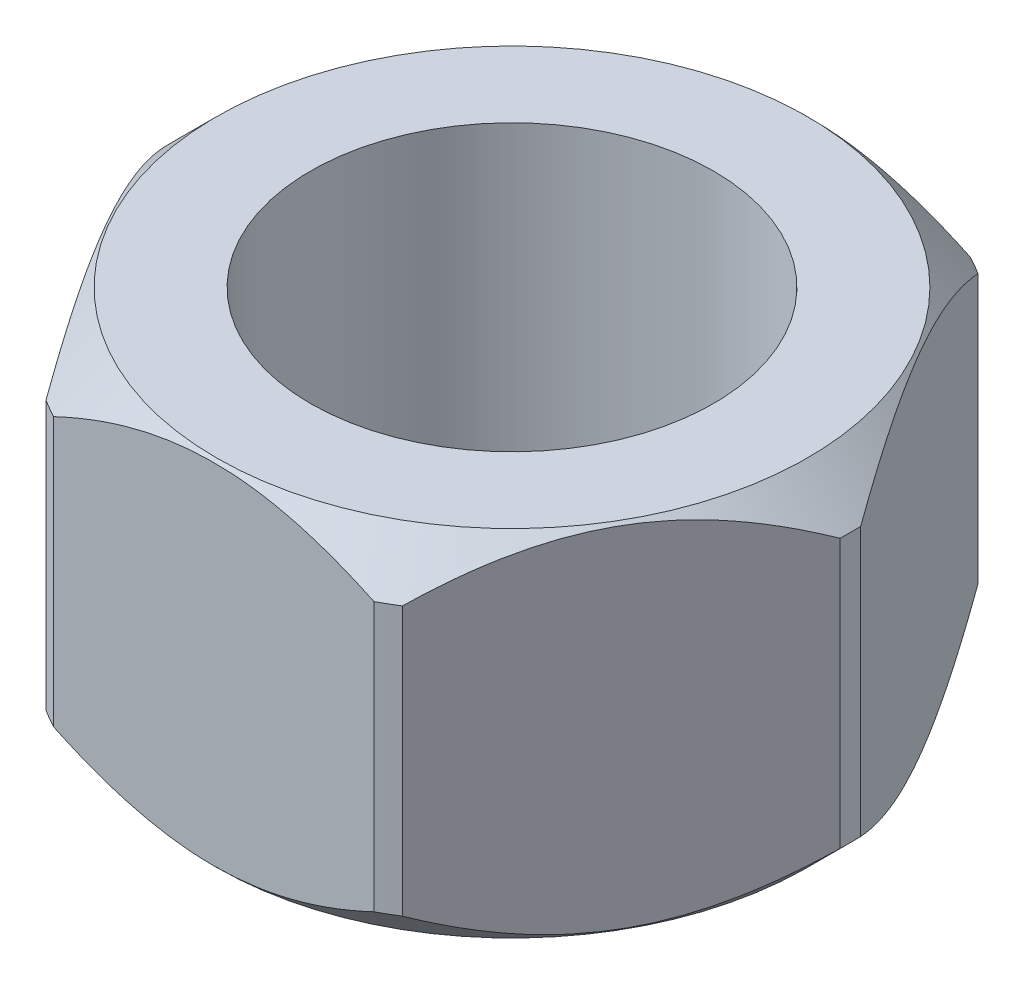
from build123d import *

# Parameters (mm, degrees)
SKETCH2_R      = 8.001
EXTRUDE2_DEPTH = 8.382
CHAMFER1_SIZE  = 1.016
EXTRUDE3_REACH = 16.082
SKETCH1_R      = 4.7625


with BuildPart() as part:
    # Sketch2 → Extrude2 (new body)
    with BuildSketch(Plane(origin=(0, 0, 0), x_dir=(1, 0, 0), z_dir=(0, 1, 0))):
        with Locations(Location((0, 0, 0), (0, 0, 90))):
            Circle(SKETCH2_R)
    extrude(amount=EXTRUDE2_DEPTH)

    # Chamfer1
    chamfer1_edges = [part.edges().sort_by_distance(p)[0] for p in [
        (0, 0, 8.001),
        (0, 8.382, 8.001),
    ]]
    chamfer(chamfer1_edges, length=CHAMFER1_SIZE)

    # Sketch1 → Extrude3 (cut, up to next)
    with BuildSketch(Plane(origin=(0, 0, 0), x_dir=(1, 0, 0), z_dir=(0, 1, 0)), mode=Mode.PRIVATE) as extrude3_sk1:
        with BuildLine():
            ThreePointArc((-8.138906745, 0), (-7.0485, -4.069453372), (-4.069453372, -7.0485))
            Line((-4.069453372, -7.0485), (-8.138906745, 0))
        make_face()
    extrude3_tool1 = extrude(extrude3_sk1.sketch, amount=EXTRUDE3_REACH, mode=Mode.PRIVATE) & part.part
    # Sketch1 → Extrude3 (cut, up to next)
    with BuildSketch(Plane(origin=(0, 0, 0), x_dir=(1, 0, 0), z_dir=(0, 1, 0)), mode=Mode.PRIVATE) as extrude3_sk2:
        with BuildLine():
            ThreePointArc((-4.069453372, 7.0485), (-7.0485, 4.069453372), (-8.138906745, 0))
            Line((-8.138906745, 0), (-4.069453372, 7.0485))
        make_face()
    extrude3_tool2 = extrude(extrude3_sk2.sketch, amount=EXTRUDE3_REACH, mode=Mode.PRIVATE) & part.part
    # Sketch1 → Extrude3 (cut, up to next)
    with BuildSketch(Plane(origin=(0, 0, 0), x_dir=(1, 0, 0), z_dir=(0, 1, 0)), mode=Mode.PRIVATE) as extrude3_sk3:
        with Locations(Location((0, 0, 0), (0, 0, 270))):
            Circle(SKETCH1_R)
    extrude3_tool3 = extrude(extrude3_sk3.sketch, amount=EXTRUDE3_REACH, mode=Mode.PRIVATE) & part.part
    # Sketch1 → Extrude3 (cut, up to next)
    with BuildSketch(Plane(origin=(0, 0, 0), x_dir=(1, 0, 0), z_dir=(0, 1, 0)), mode=Mode.PRIVATE) as extrude3_sk4:
        with BuildLine():
            Line((-4.069453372, 7.0485), (4.069453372, 7.0485))
            ThreePointArc((4.069453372, 7.0485), (0, 8.138906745), (-4.069453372, 7.0485))
        make_face()
    extrude3_tool4 = extrude(extrude3_sk4.sketch, amount=EXTRUDE3_REACH, mode=Mode.PRIVATE) & part.part
    # Sketch1 → Extrude3 (cut, up to next)
    with BuildSketch(Plane(origin=(0, 0, 0), x_dir=(1, 0, 0), z_dir=(0, 1, 0)), mode=Mode.PRIVATE) as extrude3_sk5:
        with BuildLine():
            Line((4.069453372, 7.0485), (8.138906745, 0))
            ThreePointArc((8.138906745, 0), (7.0485, 4.069453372), (4.069453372, 7.0485))
        make_face()
    extrude3_tool5 = extrude(extrude3_sk5.sketch, amount=EXTRUDE3_REACH, mode=Mode.PRIVATE) & part.part
    # Sketch1 → Extrude3 (cut, up to next)
    with BuildSketch(Plane(origin=(0, 0, 0), x_dir=(1, 0, 0), z_dir=(0, 1, 0)), mode=Mode.PRIVATE) as extrude3_sk6:
        with BuildLine():
            Line((8.138906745, 0), (4.069453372, -7.0485))
            ThreePointArc((4.069453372, -7.0485), (7.0485, -4.069453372), (8.138906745, 0))
        make_face()
    extrude3_tool6 = extrude(extrude3_sk6.sketch, amount=EXTRUDE3_REACH, mode=Mode.PRIVATE) & part.part
    # Sketch1 → Extrude3 (cut, up to next)
    with BuildSketch(Plane(origin=(0, 0, 0), x_dir=(1, 0, 0), z_dir=(0, 1, 0)), mode=Mode.PRIVATE) as extrude3_sk7:
        with BuildLine():
            ThreePointArc((-4.069453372, -7.0485), (0, -8.138906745), (4.069453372, -7.0485))
            Line((4.069453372, -7.0485), (-4.069453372, -7.0485))
        make_face()
    extrude3_tool7 = extrude(extrude3_sk7.sketch, amount=EXTRUDE3_REACH, mode=Mode.PRIVATE) & part.part
    add(extrude3_tool1.solids().sort_by_distance((-6.484164, 0, 3.743634))[0], mode=Mode.SUBTRACT)
    add(extrude3_tool2.solids().sort_by_distance((-6.484164, 0, -3.743634))[0], mode=Mode.SUBTRACT)
    add(extrude3_tool3.solids().sort_by_distance((0, 0, 0))[0], mode=Mode.SUBTRACT)
    add(extrude3_tool4.solids().sort_by_distance((0, 0, -7.487268))[0], mode=Mode.SUBTRACT)
    add(extrude3_tool5.solids().sort_by_distance((6.484164, 0, -3.743634))[0], mode=Mode.SUBTRACT)
    add(extrude3_tool6.solids().sort_by_distance((6.484164, 0, 3.743634))[0], mode=Mode.SUBTRACT)
    add(extrude3_tool7.solids().sort_by_distance((0, 0, 7.487268))[0], mode=Mode.SUBTRACT)


solid = part.part
